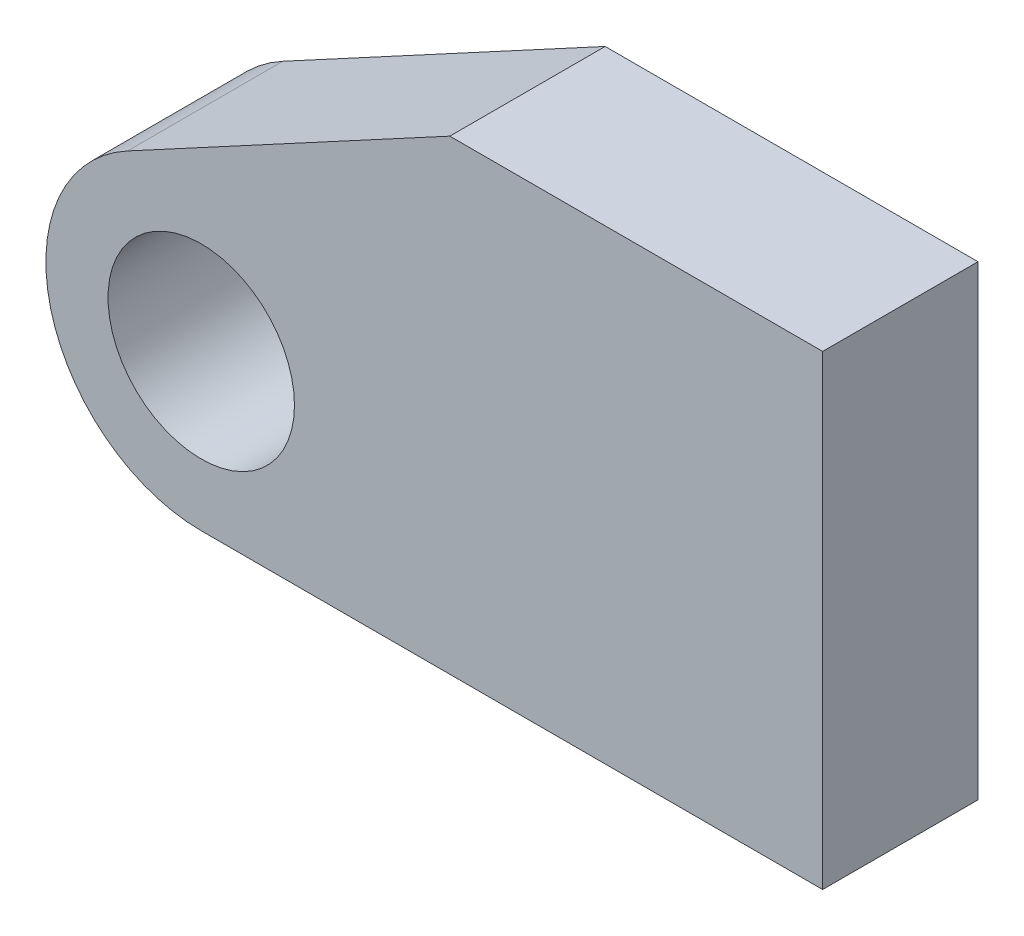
from build123d import *

# Parameters (mm, degrees)
ESQUISSE1_R      = 30
EXTRUSION1_DEPTH = 50


with BuildPart() as part:
    # Esquisse1 → Extrusion1 (new body)
    with BuildSketch(Plane.XY):
        with BuildLine():
            Line((0, -50), (200, -50))
            Line((200, -50), (200, 100))
            Line((200, 100), (80, 100))
            Line((80, 100), (-23.749469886, 43.999575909))
            ThreePointArc((-23.749469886, 43.999575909), (-48.47668922, -12.247881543), (0, -50))
        make_face()
        Circle(ESQUISSE1_R, mode=Mode.SUBTRACT)
    extrude(amount=EXTRUSION1_DEPTH)


solid = part.part
